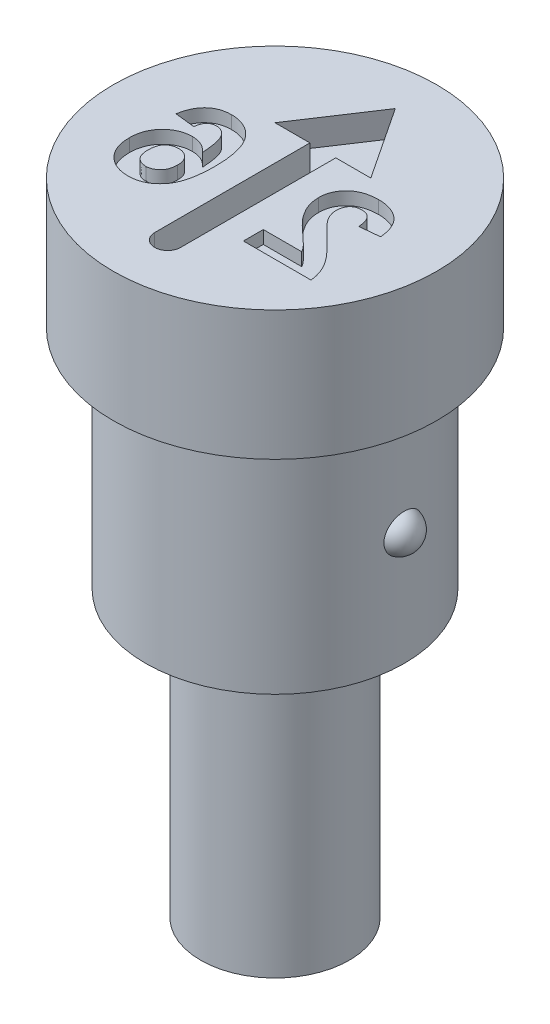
from build123d import *

# Parameters (mm, degrees)
CUT_EXTRUDE1_DEPTH = 0.4
CUT_EXTRUDE2_DEPTH = 0.2


with BuildPart() as part:
    # Sketch1 → Revolve1 (revolve)
    with BuildSketch(Plane.XY, mode=Mode.PRIVATE) as revolve1_sk:
        Polygon((0, 0), (-2.5, 0), (-2.5, -2), (-2, -2), (-2, -5.5), (-1.15, -5.5), (-1.15, -9.9), (0, -9.9), align=None)
    revolve(revolve1_sk.sketch.rotate(Axis((0, 0, 0), (0, -1, 0)), 270), axis=Axis((0, 0, 0), (0, -1, 0)))

    # Sketch3 → Cut-Extrude1 (cut)
    with BuildSketch(Plane(origin=(0, 0, 0), x_dir=(1, 0, 0), z_dir=(0, 1, 0))):
        with BuildLine():
            Line((0, 1.86), (-0.741311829, 0.74))
            Line((-0.741311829, 0.74), (-0.2, 0.74))
            Line((-0.2, 0.74), (-0.2, -1.66))
            ThreePointArc((-0.2, -1.66), (0, -1.86), (0.2, -1.66))
            Line((0.2, -1.66), (0.2, 0.74))
            Line((0.2, 0.74), (0.741311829, 0.74))
            Line((0.741311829, 0.74), (0, 1.86))
        make_face()
    extrude(amount=-CUT_EXTRUDE1_DEPTH, mode=Mode.SUBTRACT)

    # Sketch4 → Cut-Extrude2 (cut)
    # profile 1 of 2: a face of its own
    with BuildSketch(Plane(origin=(0, 0, 0), x_dir=(1, 0, 0), z_dir=(0, 1, 0))):
        with BuildLine():
            Line((0.599086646, -0.780287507), (0.599086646, -1.087979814))
            Line((0.599086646, -1.087979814), (1.645240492, -1.087979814))
            add(Edge.make_bspline(
                [(1.645240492, -1.087979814), (1.641698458, -1.061683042), (1.634616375, -1.009104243), (1.612721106, -0.932299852), (1.583498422, -0.857351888), (1.551782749, -0.796362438), (1.520238, -0.747268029), (1.491617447, -0.707039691), (1.457474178, -0.664238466), (1.41830365, -0.61851883), (1.374322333, -0.569737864), (1.3252021, -0.518076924), (1.270708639, -0.463783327), (1.232371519, -0.426915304), (1.212548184, -0.407851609)],
                knots=[0, 0, 0, 0, 1.156289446, 2.311930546, 3.473459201, 4.661751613, 5.303057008, 6.018253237, 6.81459331, 7.690699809, 8.644447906, 9.679642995, 10.800191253, 12, 12, 12, 12], degree=3))
            add(Edge.make_bspline(
                [(1.212548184, -0.407851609), (1.196728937, -0.392581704), (1.166613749, -0.363512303), (1.123729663, -0.321886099), (1.086030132, -0.283619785), (1.052726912, -0.249705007), (1.024589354, -0.219278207), (1.001247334, -0.192817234), (0.982405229, -0.17021433), (0.972200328, -0.155875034), (0.96767639, -0.149518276)],
                knots=[0, 0, 0, 0, 1.480720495, 2.818855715, 4.024636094, 5.098235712, 6.019786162, 6.815086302, 7.474715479, 8, 8, 8, 8], degree=3))
            add(Edge.make_bspline(
                [(0.96767639, -0.149518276), (0.958412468, -0.134129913), (0.940543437, -0.104447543), (0.920948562, -0.057771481), (0.909186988, -0.01110506), (0.907572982, 0.020077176), (0.906778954, 0.035417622)],
                knots=[0, 0, 0, 0, 1.0911822, 2.104764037, 3.067617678, 4, 4, 4, 4], degree=3))
            add(Edge.make_bspline(
                [(0.906778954, 0.035417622), (0.90735522, 0.051381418), (0.908445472, 0.081583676), (0.917587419, 0.124204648), (0.933799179, 0.16084341), (0.956119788, 0.191612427), (0.984344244, 0.215719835), (1.017339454, 0.233532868), (1.055588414, 0.243381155), (1.08247204, 0.244676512), (1.096522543, 0.245353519)],
                knots=[0, 0, 0, 0, 1.193122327, 2.257294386, 3.237245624, 4.168877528, 5.075331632, 5.990371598, 6.949684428, 8, 8, 8, 8], degree=3))
            add(Edge.make_bspline(
                [(1.096522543, 0.245353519), (1.110478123, 0.244721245), (1.137437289, 0.243499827), (1.175752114, 0.232829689), (1.209270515, 0.214358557), (1.233157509, 0.193308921), (1.249294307, 0.172839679), (1.260289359, 0.155002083), (1.269766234, 0.134733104), (1.278163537, 0.112260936), (1.284796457, 0.087328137), (1.290138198, 0.060124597), (1.294442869, 0.03050392), (1.29581183, 0.009897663), (1.296522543, -0.000800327)],
                knots=[0, 0, 0, 0, 1.402788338, 2.709884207, 3.961032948, 5.225417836, 5.883680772, 6.578928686, 7.329201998, 8.132101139, 8.990263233, 9.922304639, 10.921339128, 12, 12, 12, 12], degree=3))
            Line((1.296522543, -0.000800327), (1.604214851, 0.029327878))
            add(Edge.make_bspline(
                [(1.604214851, 0.029327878), (1.601741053, 0.050100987), (1.596944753, 0.090376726), (1.584975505, 0.148226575), (1.569816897, 0.201595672), (1.550746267, 0.250384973), (1.528551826, 0.294904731), (1.502101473, 0.334486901), (1.472319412, 0.369569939), (1.439179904, 0.400135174), (1.402893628, 0.426279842), (1.364817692, 0.44961797), (1.324207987, 0.468762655), (1.281511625, 0.484540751), (1.236747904, 0.497150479), (1.189709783, 0.50548786), (1.140687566, 0.511352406), (1.107224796, 0.511794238), (1.090112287, 0.512020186)],
                knots=[0, 0, 0, 0, 1.270971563, 2.464210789, 3.586263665, 4.638946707, 5.643716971, 6.603612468, 7.52484387, 8.434700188, 9.336036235, 10.239171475, 11.145359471, 12.059630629, 13.003312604, 13.96741569, 14.960557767, 16, 16, 16, 16], degree=3))
            add(Edge.make_bspline(
                [(1.090112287, 0.512020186), (1.071508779, 0.511662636), (1.035276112, 0.510966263), (0.98238285, 0.505215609), (0.932693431, 0.49518851), (0.885773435, 0.481906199), (0.842104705, 0.464173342), (0.801323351, 0.442735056), (0.764071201, 0.416777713), (0.72979296, 0.387716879), (0.699150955, 0.355759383), (0.672311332, 0.321671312), (0.649825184, 0.285476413), (0.630955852, 0.247615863), (0.616945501, 0.20748043), (0.60673695, 0.165625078), (0.599968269, 0.121854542), (0.599383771, 0.091960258), (0.599086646, 0.076763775)],
                knots=[0, 0, 0, 0, 1.210756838, 2.35810096, 3.457354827, 4.507168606, 5.527358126, 6.519769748, 7.499700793, 8.476517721, 9.440526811, 10.376769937, 11.295256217, 12.209626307, 13.124630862, 14.055668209, 15.011616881, 16, 16, 16, 16], degree=3))
            add(Edge.make_bspline(
                [(0.599086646, 0.076763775), (0.599478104, 0.059323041), (0.600254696, 0.024723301), (0.607689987, -0.026425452), (0.619049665, -0.076394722), (0.635838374, -0.125306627), (0.657119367, -0.174334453), (0.684551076, -0.223588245), (0.716401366, -0.274553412), (0.741338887, -0.307504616), (0.754214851, -0.324518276)],
                knots=[0, 0, 0, 0, 0.953409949, 1.89141903, 2.821310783, 3.752688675, 4.715703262, 5.740811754, 6.833515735, 8, 8, 8, 8], degree=3))
            add(Edge.make_bspline(
                [(0.754214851, -0.324518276), (0.7590814, -0.330647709), (0.76950442, -0.343775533), (0.787236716, -0.363905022), (0.807786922, -0.38589277), (0.830864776, -0.410150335), (0.857232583, -0.435818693), (0.885941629, -0.463971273), (0.918255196, -0.493167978), (0.951724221, -0.524137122), (0.985338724, -0.554278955), (1.0162353, -0.582907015), (1.044299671, -0.608236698), (1.068224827, -0.631666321), (1.089418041, -0.651596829), (1.107115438, -0.669050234), (1.121648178, -0.683604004), (1.14167336, -0.706289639), (1.16715313, -0.736971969), (1.18507919, -0.766289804), (1.193637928, -0.780287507)],
                knots=[0, 0, 0, 0, 0.665555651, 1.425465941, 2.280616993, 3.225313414, 4.272635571, 5.410053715, 6.644756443, 7.976022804, 9.288331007, 10.484517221, 11.558462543, 12.503158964, 13.33222979, 14.032602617, 14.617328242, 15.080653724, 16.606167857, 18, 18, 18, 18], degree=3))
            Line((1.193637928, -0.780287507), (0.599086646, -0.780287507))
        make_face()
    # profile 2 of 2: a face of its own
    with BuildSketch(Plane(origin=(0, 0, 0), x_dir=(1, 0, 0), z_dir=(0, 1, 0))):
        with BuildLine():
            Line((-1.624503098, 0.094391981), (-1.31681079, 0.060738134))
            add(Edge.make_bspline(
                [(-1.31681079, 0.060738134), (-1.314749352, 0.075557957), (-1.310870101, 0.103446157), (-1.299379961, 0.141931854), (-1.283384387, 0.174308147), (-1.262852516, 0.200620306), (-1.238396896, 0.220871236), (-1.210531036, 0.235260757), (-1.179272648, 0.243802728), (-1.157357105, 0.244823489), (-1.145977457, 0.245353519)],
                knots=[0, 0, 0, 0, 1.280716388, 2.410074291, 3.425374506, 4.35753932, 5.248331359, 6.12451615, 7.026154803, 8, 8, 8, 8], degree=3))
            add(Edge.make_bspline(
                [(-1.145977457, 0.245353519), (-1.138260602, 0.245164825), (-1.12290445, 0.244789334), (-1.10053635, 0.240022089), (-1.07897081, 0.232947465), (-1.058383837, 0.222927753), (-1.038672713, 0.209999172), (-1.020137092, 0.19400719), (-1.001924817, 0.17579478), (-0.985107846, 0.153802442), (-0.96897392, 0.127761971), (-0.955081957, 0.095883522), (-0.942700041, 0.058196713), (-0.932098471, 0.014516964), (-0.922477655, -0.034878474), (-0.914591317, -0.09018956), (-0.908280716, -0.151465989), (-0.905253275, -0.194379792), (-0.903669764, -0.216825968)],
                knots=[0, 0, 0, 0, 0.642458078, 1.278459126, 1.898279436, 2.531842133, 3.181731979, 3.858193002, 4.57010051, 5.325711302, 6.161524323, 7.118599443, 8.217371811, 9.466325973, 10.864147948, 12.412648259, 14.123626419, 16, 16, 16, 16], degree=3))
            add(Edge.make_bspline(
                [(-0.903669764, -0.216825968), (-0.913503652, -0.20614507), (-0.932786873, -0.185200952), (-0.964783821, -0.157894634), (-0.998305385, -0.134549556), (-1.033716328, -0.115396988), (-1.071209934, -0.101144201), (-1.110107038, -0.090322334), (-1.150916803, -0.084260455), (-1.178650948, -0.083326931), (-1.192772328, -0.082851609)],
                knots=[0, 0, 0, 0, 1.057745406, 2.074127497, 3.059409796, 4.031705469, 5.000875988, 5.977809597, 6.970362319, 8, 8, 8, 8], degree=3))
            add(Edge.make_bspline(
                [(-1.192772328, -0.082851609), (-1.208709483, -0.083310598), (-1.240179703, -0.084216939), (-1.286542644, -0.090573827), (-1.33103093, -0.102004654), (-1.373845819, -0.117467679), (-1.415198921, -0.136939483), (-1.454299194, -0.16158788), (-1.491760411, -0.190326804), (-1.527067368, -0.223160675), (-1.55950597, -0.25930801), (-1.588146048, -0.298349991), (-1.611715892, -0.340405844), (-1.631865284, -0.384534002), (-1.646857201, -0.431605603), (-1.657739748, -0.480943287), (-1.664235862, -0.532999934), (-1.665090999, -0.568516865), (-1.665528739, -0.586697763)],
                knots=[0, 0, 0, 0, 0.99135015, 1.957564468, 2.903754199, 3.843479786, 4.78583385, 5.741106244, 6.712813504, 7.719198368, 8.735844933, 9.730198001, 10.724351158, 11.729813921, 12.742848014, 13.790983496, 14.86921809, 16, 16, 16, 16], degree=3))
            add(Edge.make_bspline(
                [(-1.665528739, -0.586697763), (-1.66508461, -0.605944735), (-1.664218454, -0.643480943), (-1.657842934, -0.698453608), (-1.646581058, -0.750341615), (-1.631194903, -0.799561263), (-1.61129336, -0.84572254), (-1.587184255, -0.889205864), (-1.558051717, -0.929268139), (-1.525217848, -0.966448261), (-1.488614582, -0.999626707), (-1.449605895, -1.029006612), (-1.407759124, -1.053429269), (-1.363692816, -1.073985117), (-1.3166501, -1.089070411), (-1.267460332, -1.100383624), (-1.215723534, -1.107283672), (-1.180400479, -1.108083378), (-1.16232361, -1.108492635)],
                knots=[0, 0, 0, 0, 1.13287417, 2.209376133, 3.25169942, 4.254157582, 5.240146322, 6.205890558, 7.174579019, 8.150183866, 9.1206468, 10.07783463, 11.019441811, 11.967766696, 12.934309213, 13.921380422, 14.936249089, 16, 16, 16, 16], degree=3))
            add(Edge.make_bspline(
                [(-1.16232361, -1.108492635), (-1.142954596, -1.107950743), (-1.104871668, -1.106885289), (-1.049122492, -1.098117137), (-0.996120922, -1.08328281), (-0.945873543, -1.062566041), (-0.897962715, -1.036507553), (-0.852833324, -1.00413816), (-0.810604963, -0.965766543), (-0.770719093, -0.921912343), (-0.73442402, -0.871257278), (-0.703514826, -0.812710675), (-0.677300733, -0.746913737), (-0.65595862, -0.673697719), (-0.63948405, -0.59306843), (-0.627988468, -0.505019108), (-0.620353, -0.409695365), (-0.61970864, -0.343658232), (-0.619374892, -0.309454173)],
                knots=[0, 0, 0, 0, 0.852151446, 1.675481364, 2.476404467, 3.269281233, 4.062617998, 4.871616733, 5.707301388, 6.56955125, 7.476395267, 8.442009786, 9.475854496, 10.58877921, 11.794095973, 13.094195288, 14.494932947, 16, 16, 16, 16], degree=3))
            add(Edge.make_bspline(
                [(-0.619374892, -0.309454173), (-0.619853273, -0.274397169), (-0.620777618, -0.20665859), (-0.62821574, -0.108853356), (-0.640030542, -0.018534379), (-0.65724176, 0.064094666), (-0.679256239, 0.139205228), (-0.705945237, 0.206948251), (-0.737979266, 0.267078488), (-0.775223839, 0.319400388), (-0.816203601, 0.364881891), (-0.860236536, 0.40414015), (-0.907154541, 0.437554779), (-0.95695649, 0.465041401), (-1.010051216, 0.485878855), (-1.0659351, 0.500926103), (-1.124702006, 0.51059673), (-1.164956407, 0.511540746), (-1.185400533, 0.512020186)],
                knots=[0, 0, 0, 0, 1.491699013, 2.882321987, 4.171520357, 5.365488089, 6.470299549, 7.49861535, 8.458736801, 9.361983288, 10.224742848, 11.058789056, 11.867429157, 12.671146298, 13.473202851, 14.288259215, 15.130652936, 16, 16, 16, 16], degree=3))
            add(Edge.make_bspline(
                [(-1.185400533, 0.512020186), (-1.19984096, 0.511760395), (-1.228070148, 0.511252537), (-1.269444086, 0.505859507), (-1.308914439, 0.497612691), (-1.346584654, 0.486197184), (-1.382189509, 0.470909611), (-1.41587039, 0.452285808), (-1.447740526, 0.430376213), (-1.477634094, 0.405321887), (-1.505310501, 0.377047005), (-1.530301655, 0.345487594), (-1.552773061, 0.311024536), (-1.572823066, 0.273686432), (-1.589640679, 0.233115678), (-1.604098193, 0.189631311), (-1.615988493, 0.143139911), (-1.621621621, 0.110889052), (-1.624503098, 0.094391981)],
                knots=[0, 0, 0, 0, 1.036027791, 2.025301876, 2.989435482, 3.928225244, 4.845595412, 5.765526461, 6.686607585, 7.61747015, 8.561102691, 9.521661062, 10.50224679, 11.510949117, 12.559251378, 13.650572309, 14.798212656, 16, 16, 16, 16], degree=3))
        make_face()
        with BuildLine():
            add(Edge.make_bspline(
                [(-0.9270672, -0.579646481), (-0.927184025, -0.589808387), (-0.927412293, -0.60966417), (-0.931155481, -0.638476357), (-0.936535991, -0.665487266), (-0.943783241, -0.690846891), (-0.953828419, -0.714171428), (-0.96574614, -0.735928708), (-0.979843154, -0.755921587), (-1.001473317, -0.779379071), (-1.031362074, -0.804016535), (-1.070586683, -0.825956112), (-1.112614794, -0.839594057), (-1.141604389, -0.841077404), (-1.156233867, -0.841825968)],
                knots=[0, 0, 0, 0, 0.93816693, 1.833124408, 2.679057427, 3.481731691, 4.264557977, 5.020023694, 5.770442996, 6.518065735, 7.962605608, 9.32780964, 10.651490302, 12, 12, 12, 12], degree=3))
            add(Edge.make_bspline(
                [(-1.156233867, -0.841825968), (-1.170092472, -0.841203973), (-1.197066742, -0.839993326), (-1.235586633, -0.828928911), (-1.270576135, -0.811479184), (-1.296226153, -0.79099303), (-1.314111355, -0.771067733), (-1.326129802, -0.753593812), (-1.335912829, -0.733660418), (-1.343910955, -0.711595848), (-1.350353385, -0.687485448), (-1.354751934, -0.661086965), (-1.357246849, -0.632472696), (-1.357635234, -0.612664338), (-1.357836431, -0.602402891)],
                knots=[0, 0, 0, 0, 1.399678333, 2.724321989, 4.020062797, 5.33532049, 6.016755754, 6.724441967, 7.473839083, 8.257094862, 9.096253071, 9.995581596, 10.961638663, 12, 12, 12, 12], degree=3))
            add(Edge.make_bspline(
                [(-1.357836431, -0.602402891), (-1.357664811, -0.591819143), (-1.357333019, -0.571357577), (-1.354429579, -0.541783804), (-1.349679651, -0.514444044), (-1.343038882, -0.489145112), (-1.33404989, -0.466225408), (-1.323445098, -0.445222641), (-1.310569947, -0.426706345), (-1.291435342, -0.404928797), (-1.263612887, -0.382984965), (-1.226436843, -0.362997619), (-1.184766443, -0.351666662), (-1.155765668, -0.350247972), (-1.140849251, -0.349518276)],
                knots=[0, 0, 0, 0, 1.008384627, 1.949510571, 2.828269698, 3.650667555, 4.437180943, 5.170285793, 5.887596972, 6.580056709, 7.926803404, 9.238379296, 10.579573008, 12, 12, 12, 12], degree=3))
            add(Edge.make_bspline(
                [(-1.140849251, -0.349518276), (-1.126346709, -0.350109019), (-1.098180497, -0.351256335), (-1.05770232, -0.362777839), (-1.020664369, -0.381110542), (-0.993383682, -0.402647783), (-0.974155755, -0.422945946), (-0.961562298, -0.440228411), (-0.95060031, -0.459044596), (-0.941943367, -0.479881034), (-0.935268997, -0.502346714), (-0.9304819, -0.526595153), (-0.927585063, -0.552545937), (-0.927242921, -0.570450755), (-0.9270672, -0.579646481)],
                knots=[0, 0, 0, 0, 1.469034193, 2.853094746, 4.235454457, 5.641396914, 6.354997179, 7.06867986, 7.807229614, 8.560602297, 9.353235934, 10.182779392, 11.06669468, 12, 12, 12, 12], degree=3))
        make_face(mode=Mode.SUBTRACT)
    extrude(amount=-CUT_EXTRUDE2_DEPTH, mode=Mode.SUBTRACT)

    # Sketch5 → Revolve2 (revolve)
    with BuildSketch(Plane.XY):
        with BuildLine():
            Line((1.917379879, -3.45), (1.917379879, -4.05))
            ThreePointArc((1.917379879, -4.05), (2.217379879, -3.75), (1.917379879, -3.45))
        make_face()
    revolve(axis=Axis((1.917379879, -3.45, 0), (0, -1, 0)))


solid = part.part
